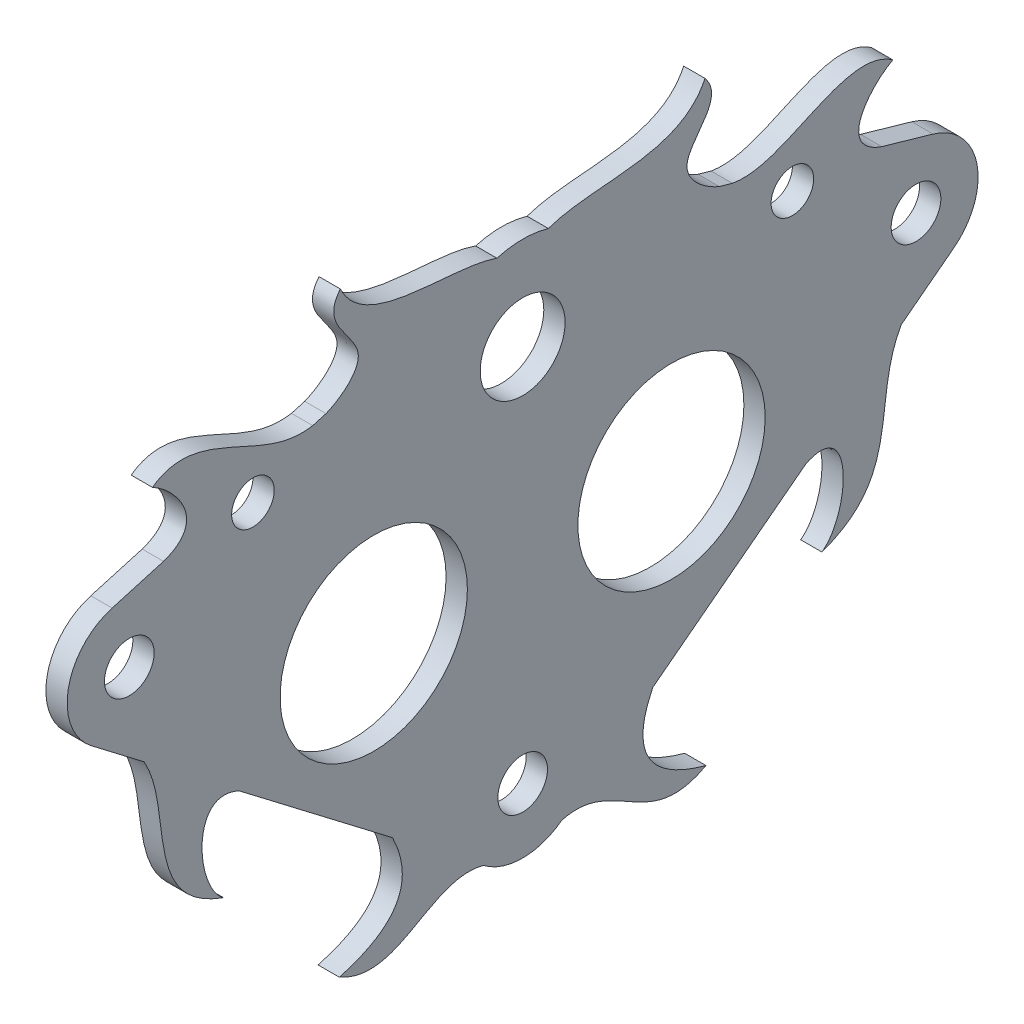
ISO-10303-21;
HEADER;
FILE_DESCRIPTION(('STEP AP214'),'2;1');
FILE_NAME('part.step','',(''),(''),'','','');
FILE_SCHEMA(('AUTOMOTIVE_DESIGN { 1 0 10303 214 1 1 1 1 }'));
ENDSEC;
DATA;
#1=APPLICATION_CONTEXT('core data for automotive mechanical design processes');
#2=APPLICATION_PROTOCOL_DEFINITION('international standard','automotive_design',2000,#1);
#3=PRODUCT_CONTEXT('',#1,'mechanical');
#4=PRODUCT('Part','Part','',(#3));
#5=PRODUCT_RELATED_PRODUCT_CATEGORY('part','',(#4));
#6=PRODUCT_DEFINITION_FORMATION('','',#4);
#7=PRODUCT_DEFINITION_CONTEXT('part definition',#1,'design');
#8=PRODUCT_DEFINITION('design','',#6,#7);
#9=PRODUCT_DEFINITION_SHAPE('','',#8);
#10=(LENGTH_UNIT() NAMED_UNIT(*) SI_UNIT(.MILLI.,.METRE.));
#11=(NAMED_UNIT(*) PLANE_ANGLE_UNIT() SI_UNIT($,.RADIAN.));
#12=(NAMED_UNIT(*) SI_UNIT($,.STERADIAN.) SOLID_ANGLE_UNIT());
#13=UNCERTAINTY_MEASURE_WITH_UNIT(LENGTH_MEASURE(1.E-05),#10,'distance_accuracy_value','');
#14=(GEOMETRIC_REPRESENTATION_CONTEXT(3) GLOBAL_UNCERTAINTY_ASSIGNED_CONTEXT((#13)) GLOBAL_UNIT_ASSIGNED_CONTEXT((#10,
#11,#12)) REPRESENTATION_CONTEXT('',''));
#15=CARTESIAN_POINT('',(0.,0.,0.));
#16=DIRECTION('',(0.,0.,1.));
#17=DIRECTION('',(1.,0.,0.));
#18=AXIS2_PLACEMENT_3D('',#15,#16,#17);
#19=CARTESIAN_POINT('',(-2.05703193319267,-31.9986930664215,25.7505001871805));
#20=DIRECTION('',(0.,-0.794497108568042,0.607267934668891));
#21=DIRECTION('',(0.,-0.607267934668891,-0.794497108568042));
#22=AXIS2_PLACEMENT_3D('',#19,#20,#21);
#23=PLANE('',#22);
#24=DIRECTION('',(1.,0.,0.));
#25=VECTOR('',#24,1.);
#26=CARTESIAN_POINT('',(-2.05703193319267,-21.1625366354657,39.9275947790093));
#27=LINE('',#26,#25);
#28=CARTESIAN_POINT('',(-2.05703193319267,-21.1625366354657,39.9275947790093));
#29=VERTEX_POINT('',#28);
#30=CARTESIAN_POINT('',(0.942968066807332,-21.1625366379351,39.9275947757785));
#31=VERTEX_POINT('',#30);
#32=EDGE_CURVE('E687',#29,#31,#27,.T.);
#33=ORIENTED_EDGE('',*,*,#32,.F.);
#34=DIRECTION('',(0.,-0.607267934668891,-0.794497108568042));
#35=VECTOR('',#34,1.);
#36=CARTESIAN_POINT('',(-2.05703193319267,-31.9986930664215,25.7505001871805));
#37=LINE('',#36,#35);
#38=CARTESIAN_POINT('',(-2.05703193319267,-37.6674903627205,18.333933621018));
#39=VERTEX_POINT('',#38);
#40=EDGE_CURVE('E43',#29,#39,#37,.T.);
#41=ORIENTED_EDGE('',*,*,#40,.T.);
#42=DIRECTION('',(1.,0.,0.));
#43=VECTOR('',#42,1.);
#44=CARTESIAN_POINT('',(-2.05703193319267,-37.6674903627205,18.333933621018));
#45=LINE('',#44,#43);
#46=CARTESIAN_POINT('',(0.942968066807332,-37.6674903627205,18.333933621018));
#47=VERTEX_POINT('',#46);
#48=EDGE_CURVE('E406',#39,#47,#45,.T.);
#49=ORIENTED_EDGE('',*,*,#48,.T.);
#50=DIRECTION('',(0.,-0.607267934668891,-0.794497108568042));
#51=VECTOR('',#50,1.);
#52=CARTESIAN_POINT('',(0.942968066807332,-31.9986930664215,25.7505001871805));
#53=LINE('',#52,#51);
#54=EDGE_CURVE('E62',#31,#47,#53,.T.);
#55=ORIENTED_EDGE('',*,*,#54,.F.);
#56=EDGE_LOOP('',(#33,#41,#49,#55));
#57=FACE_BOUND('',#56,.T.);
#58=ADVANCED_FACE('F39',(#57),#23,.T.);
#59=DIRECTION('',(1.,0.,0.));
#60=VECTOR('',#59,1.);
#61=CARTESIAN_POINT('',(-2.05703193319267,-10.9212101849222,53.3264650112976));
#62=LINE('',#61,#60);
#63=CARTESIAN_POINT('',(-2.05703193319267,-10.9212101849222,53.3264650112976));
#64=VERTEX_POINT('',#63);
#65=CARTESIAN_POINT('',(0.942968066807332,-10.9212101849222,53.3264650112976));
#66=VERTEX_POINT('',#65);
#67=EDGE_CURVE('E228',#64,#66,#62,.T.);
#68=ORIENTED_EDGE('',*,*,#67,.T.);
#69=CARTESIAN_POINT('',(0.942968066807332,-5.26166880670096,60.7309219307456));
#70=VERTEX_POINT('',#69);
#71=EDGE_CURVE('E259',#70,#66,#53,.T.);
#72=ORIENTED_EDGE('',*,*,#71,.F.);
#73=DIRECTION('',(-1.,0.,0.));
#74=VECTOR('',#73,1.);
#75=CARTESIAN_POINT('',(-2.05703193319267,-5.26166880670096,60.7309219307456));
#76=LINE('',#75,#74);
#77=CARTESIAN_POINT('',(-2.05703193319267,-5.26166880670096,60.7309219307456));
#78=VERTEX_POINT('',#77);
#79=EDGE_CURVE('E49',#70,#78,#76,.T.);
#80=ORIENTED_EDGE('',*,*,#79,.T.);
#81=EDGE_CURVE('E247',#78,#64,#37,.T.);
#82=ORIENTED_EDGE('',*,*,#81,.T.);
#83=EDGE_LOOP('',(#68,#72,#80,#82));
#84=FACE_BOUND('',#83,.T.);
#85=ADVANCED_FACE('F251',(#84),#23,.T.);
#86=CARTESIAN_POINT('',(-2.05703193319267,-31.9986930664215,-25.7491785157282));
#87=DIRECTION('',(0.,0.794497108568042,0.607267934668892));
#88=DIRECTION('',(0.,-0.607267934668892,0.794497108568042));
#89=AXIS2_PLACEMENT_3D('',#86,#87,#88);
#90=PLANE('',#89);
#91=DIRECTION('',(0.,-0.607267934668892,0.794497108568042));
#92=VECTOR('',#91,1.);
#93=CARTESIAN_POINT('',(0.942968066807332,-31.9986930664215,-25.7491785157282));
#94=LINE('',#93,#92);
#95=CARTESIAN_POINT('',(0.942968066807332,-21.1625366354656,-39.9262731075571));
#96=VERTEX_POINT('',#95);
#97=CARTESIAN_POINT('',(0.942968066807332,-37.6674903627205,-18.3326119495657));
#98=VERTEX_POINT('',#97);
#99=EDGE_CURVE('E330',#96,#98,#94,.T.);
#100=ORIENTED_EDGE('',*,*,#99,.T.);
#101=DIRECTION('',(1.,0.,0.));
#102=VECTOR('',#101,1.);
#103=CARTESIAN_POINT('',(-2.05703193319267,-37.6674903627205,-18.3326119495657));
#104=LINE('',#103,#102);
#105=CARTESIAN_POINT('',(-2.05703193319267,-37.6674903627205,-18.3326119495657));
#106=VERTEX_POINT('',#105);
#107=EDGE_CURVE('E464',#106,#98,#104,.T.);
#108=ORIENTED_EDGE('',*,*,#107,.F.);
#109=DIRECTION('',(0.,-0.607267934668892,0.794497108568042));
#110=VECTOR('',#109,1.);
#111=CARTESIAN_POINT('',(-2.05703193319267,-31.9986930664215,-25.7491785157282));
#112=LINE('',#111,#110);
#113=CARTESIAN_POINT('',(-2.05703193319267,-21.1625366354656,-39.9262731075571));
#114=VERTEX_POINT('',#113);
#115=EDGE_CURVE('E359',#114,#106,#112,.T.);
#116=ORIENTED_EDGE('',*,*,#115,.F.);
#117=DIRECTION('',(1.,0.,0.));
#118=VECTOR('',#117,1.);
#119=CARTESIAN_POINT('',(-2.05703193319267,-21.1625366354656,-39.9262731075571));
#120=LINE('',#119,#118);
#121=EDGE_CURVE('E519',#114,#96,#120,.T.);
#122=ORIENTED_EDGE('',*,*,#121,.T.);
#123=EDGE_LOOP('',(#100,#108,#116,#122));
#124=FACE_BOUND('',#123,.T.);
#125=ADVANCED_FACE('F627',(#124),#90,.F.);
#126=CARTESIAN_POINT('',(0.942968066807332,-5.26166880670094,-60.7296002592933));
#127=VERTEX_POINT('',#126);
#128=CARTESIAN_POINT('',(0.942968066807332,-10.9212101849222,-53.3251433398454));
#129=VERTEX_POINT('',#128);
#130=EDGE_CURVE('E328',#127,#129,#94,.T.);
#131=ORIENTED_EDGE('',*,*,#130,.T.);
#132=DIRECTION('',(1.,0.,0.));
#133=VECTOR('',#132,1.);
#134=CARTESIAN_POINT('',(-2.05703193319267,-10.9212101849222,-53.3251433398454));
#135=LINE('',#134,#133);
#136=CARTESIAN_POINT('',(-2.05703193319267,-10.9212101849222,-53.3251433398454));
#137=VERTEX_POINT('',#136);
#138=EDGE_CURVE('E720',#137,#129,#135,.T.);
#139=ORIENTED_EDGE('',*,*,#138,.F.);
#140=CARTESIAN_POINT('',(-2.05703193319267,-5.26166880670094,-60.7296002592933));
#141=VERTEX_POINT('',#140);
#142=EDGE_CURVE('E358',#141,#137,#112,.T.);
#143=ORIENTED_EDGE('',*,*,#142,.F.);
#144=DIRECTION('',(-1.,0.,0.));
#145=VECTOR('',#144,1.);
#146=CARTESIAN_POINT('',(-2.05703193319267,-5.26166880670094,-60.7296002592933));
#147=LINE('',#146,#145);
#148=EDGE_CURVE('E376',#127,#141,#147,.T.);
#149=ORIENTED_EDGE('',*,*,#148,.F.);
#150=EDGE_LOOP('',(#131,#139,#143,#149));
#151=FACE_BOUND('',#150,.T.);
#152=ADVANCED_FACE('F630',(#151),#90,.F.);
#153=CARTESIAN_POINT('',(-2.05703193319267,24.8116172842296,-6.64458938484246));
#154=DIRECTION('',(0.,0.961093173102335,-0.276224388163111));
#155=DIRECTION('',(0.,0.276224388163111,0.961093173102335));
#156=AXIS2_PLACEMENT_3D('',#153,#154,#155);
#157=PLANE('',#156);
#158=DIRECTION('',(0.,0.276224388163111,0.961093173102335));
#159=VECTOR('',#158,1.);
#160=CARTESIAN_POINT('',(-2.05703193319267,24.8116172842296,-6.64458938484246));
#161=LINE('',#160,#159);
#162=CARTESIAN_POINT('',(-2.05703193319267,10.0997461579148,-57.8329692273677));
#163=VERTEX_POINT('',#162);
#164=CARTESIAN_POINT('',(-2.05703193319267,12.1792744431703,-50.5974732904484));
#165=VERTEX_POINT('',#164);
#166=EDGE_CURVE('E290',#163,#165,#161,.T.);
#167=ORIENTED_EDGE('',*,*,#166,.T.);
#168=DIRECTION('',(1.,0.,0.));
#169=VECTOR('',#168,1.);
#170=CARTESIAN_POINT('',(-2.05703193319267,12.1792744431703,-50.5974732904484));
#171=LINE('',#170,#169);
#172=CARTESIAN_POINT('',(0.942968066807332,12.1792744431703,-50.5974732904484));
#173=VERTEX_POINT('',#172);
#174=EDGE_CURVE('E526',#165,#173,#171,.T.);
#175=ORIENTED_EDGE('',*,*,#174,.T.);
#176=DIRECTION('',(0.,0.276224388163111,0.961093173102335));
#177=VECTOR('',#176,1.);
#178=CARTESIAN_POINT('',(0.942968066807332,24.8116172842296,-6.64458938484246));
#179=LINE('',#178,#177);
#180=CARTESIAN_POINT('',(0.942968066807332,10.0997461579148,-57.8329692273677));
#181=VERTEX_POINT('',#180);
#182=EDGE_CURVE('E284',#181,#173,#179,.T.);
#183=ORIENTED_EDGE('',*,*,#182,.F.);
#184=DIRECTION('',(-1.,0.,0.));
#185=VECTOR('',#184,1.);
#186=CARTESIAN_POINT('',(-2.05703193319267,10.0997461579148,-57.8329692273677));
#187=LINE('',#186,#185);
#188=EDGE_CURVE('E378',#181,#163,#187,.T.);
#189=ORIENTED_EDGE('',*,*,#188,.T.);
#190=EDGE_LOOP('',(#167,#175,#183,#189));
#191=FACE_BOUND('',#190,.T.);
#192=ADVANCED_FACE('F637',(#191),#157,.T.);
#193=CARTESIAN_POINT('',(0.942968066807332,18.2241580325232,-29.5649482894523));
#194=VERTEX_POINT('',#193);
#195=CARTESIAN_POINT('',(0.942968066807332,18.7592735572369,-27.7030711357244));
#196=VERTEX_POINT('',#195);
#197=EDGE_CURVE('E289',#194,#196,#179,.T.);
#198=ORIENTED_EDGE('',*,*,#197,.F.);
#199=DIRECTION('',(1.,0.,0.));
#200=VECTOR('',#199,1.);
#201=CARTESIAN_POINT('',(-2.05703193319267,18.22415803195,-29.5649482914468));
#202=LINE('',#201,#200);
#203=CARTESIAN_POINT('',(-2.05703193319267,18.22415803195,-29.5649482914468));
#204=VERTEX_POINT('',#203);
#205=EDGE_CURVE('E533',#204,#194,#202,.T.);
#206=ORIENTED_EDGE('',*,*,#205,.F.);
#207=CARTESIAN_POINT('',(-2.05703193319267,18.7592735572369,-27.7030711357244));
#208=VERTEX_POINT('',#207);
#209=EDGE_CURVE('E303',#204,#208,#161,.T.);
#210=ORIENTED_EDGE('',*,*,#209,.T.);
#211=DIRECTION('',(1.,0.,0.));
#212=VECTOR('',#211,1.);
#213=CARTESIAN_POINT('',(-2.05703193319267,18.7592735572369,-27.7030711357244));
#214=LINE('',#213,#212);
#215=EDGE_CURVE('E586',#208,#196,#214,.T.);
#216=ORIENTED_EDGE('',*,*,#215,.T.);
#217=EDGE_LOOP('',(#198,#206,#210,#216));
#218=FACE_BOUND('',#217,.T.);
#219=ADVANCED_FACE('F640',(#218),#157,.T.);
#220=CARTESIAN_POINT('',(-2.05703193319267,24.8116172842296,6.64591105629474));
#221=DIRECTION('',(0.,-0.961093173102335,-0.276224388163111));
#222=DIRECTION('',(0.,0.276224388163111,-0.961093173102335));
#223=AXIS2_PLACEMENT_3D('',#220,#221,#222);
#224=PLANE('',#223);
#225=DIRECTION('',(1.,0.,0.));
#226=VECTOR('',#225,1.);
#227=CARTESIAN_POINT('',(-2.05703193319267,12.1792744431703,50.5987949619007));
#228=LINE('',#227,#226);
#229=CARTESIAN_POINT('',(-2.05703193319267,12.1792744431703,50.5987949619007));
#230=VERTEX_POINT('',#229);
#231=CARTESIAN_POINT('',(0.942968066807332,12.1792744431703,50.5987949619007));
#232=VERTEX_POINT('',#231);
#233=EDGE_CURVE('E594',#230,#232,#228,.T.);
#234=ORIENTED_EDGE('',*,*,#233,.F.);
#235=DIRECTION('',(0.,0.276224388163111,-0.961093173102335));
#236=VECTOR('',#235,1.);
#237=CARTESIAN_POINT('',(-2.05703193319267,24.8116172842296,6.64591105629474));
#238=LINE('',#237,#236);
#239=CARTESIAN_POINT('',(-2.05703193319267,10.0997461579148,57.83429089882));
#240=VERTEX_POINT('',#239);
#241=EDGE_CURVE('E275',#240,#230,#238,.T.);
#242=ORIENTED_EDGE('',*,*,#241,.F.);
#243=DIRECTION('',(-1.,0.,0.));
#244=VECTOR('',#243,1.);
#245=CARTESIAN_POINT('',(-2.05703193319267,10.0997461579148,57.83429089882));
#246=LINE('',#245,#244);
#247=CARTESIAN_POINT('',(0.942968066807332,10.0997461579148,57.83429089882));
#248=VERTEX_POINT('',#247);
#249=EDGE_CURVE('E386',#248,#240,#246,.T.);
#250=ORIENTED_EDGE('',*,*,#249,.F.);
#251=DIRECTION('',(0.,0.276224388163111,-0.961093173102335));
#252=VECTOR('',#251,1.);
#253=CARTESIAN_POINT('',(0.942968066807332,24.8116172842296,6.64591105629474));
#254=LINE('',#253,#252);
#255=EDGE_CURVE('E390',#248,#232,#254,.T.);
#256=ORIENTED_EDGE('',*,*,#255,.T.);
#257=EDGE_LOOP('',(#234,#242,#250,#256));
#258=FACE_BOUND('',#257,.T.);
#259=ADVANCED_FACE('F650',(#258),#224,.F.);
#260=CARTESIAN_POINT('',(-2.05703193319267,1.69018089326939,55.4173275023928));
#261=DIRECTION('',(1.,0.,0.));
#262=DIRECTION('',(0.,0.,-1.));
#263=AXIS2_PLACEMENT_3D('',#260,#261,#262);
#264=CYLINDRICAL_SURFACE('',#263,8.74999999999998);
#265=ORIENTED_EDGE('',*,*,#79,.F.);
#266=CARTESIAN_POINT('',(0.942968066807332,1.69018089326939,55.4173275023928));
#267=DIRECTION('',(1.,0.,0.));
#268=DIRECTION('',(0.,0.,-1.));
#269=AXIS2_PLACEMENT_3D('',#266,#267,#268);
#270=CIRCLE('',#269,8.74999999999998);
#271=EDGE_CURVE('E393',#248,#70,#270,.T.);
#272=ORIENTED_EDGE('',*,*,#271,.F.);
#273=ORIENTED_EDGE('',*,*,#249,.T.);
#274=CARTESIAN_POINT('',(-2.05703193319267,1.69018089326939,55.4173275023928));
#275=DIRECTION('',(1.,0.,0.));
#276=DIRECTION('',(0.,0.,-1.));
#277=AXIS2_PLACEMENT_3D('',#274,#275,#276);
#278=CIRCLE('',#277,8.74999999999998);
#279=EDGE_CURVE('E252',#240,#78,#278,.T.);
#280=ORIENTED_EDGE('',*,*,#279,.T.);
#281=EDGE_LOOP('',(#265,#272,#273,#280));
#282=FACE_BOUND('',#281,.T.);
#283=ADVANCED_FACE('F648',(#282),#264,.T.);
#284=DIRECTION('',(1.,0.,0.));
#285=VECTOR('',#284,1.);
#286=CARTESIAN_POINT('',(-2.05703193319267,18.22415803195,29.5662699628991));
#287=LINE('',#286,#285);
#288=CARTESIAN_POINT('',(-2.05703193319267,18.2241580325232,29.5662699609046));
#289=VERTEX_POINT('',#288);
#290=CARTESIAN_POINT('',(0.942968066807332,18.22415803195,29.5662699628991));
#291=VERTEX_POINT('',#290);
#292=EDGE_CURVE('E571',#289,#291,#287,.T.);
#293=ORIENTED_EDGE('',*,*,#292,.T.);
#294=CARTESIAN_POINT('',(0.942968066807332,18.7592735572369,27.7043928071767));
#295=VERTEX_POINT('',#294);
#296=EDGE_CURVE('E281',#291,#295,#254,.T.);
#297=ORIENTED_EDGE('',*,*,#296,.T.);
#298=DIRECTION('',(1.,0.,0.));
#299=VECTOR('',#298,1.);
#300=CARTESIAN_POINT('',(-2.05703193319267,18.7592735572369,27.7043928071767));
#301=LINE('',#300,#299);
#302=CARTESIAN_POINT('',(-2.05703193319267,18.7592735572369,27.7043928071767));
#303=VERTEX_POINT('',#302);
#304=EDGE_CURVE('E335',#303,#295,#301,.T.);
#305=ORIENTED_EDGE('',*,*,#304,.F.);
#306=EDGE_CURVE('E254',#289,#303,#238,.T.);
#307=ORIENTED_EDGE('',*,*,#306,.F.);
#308=EDGE_LOOP('',(#293,#297,#305,#307));
#309=FACE_BOUND('',#308,.T.);
#310=ADVANCED_FACE('F644',(#309),#224,.F.);
#311=CARTESIAN_POINT('',(-2.05703193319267,13.0651808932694,0.000660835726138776));
#312=DIRECTION('',(1.,0.,0.));
#313=DIRECTION('',(0.,0.,-1.));
#314=AXIS2_PLACEMENT_3D('',#311,#312,#313);
#315=CYLINDRICAL_SURFACE('',#314,13.125);
#316=DIRECTION('',(-1.,0.,0.));
#317=VECTOR('',#316,1.);
#318=CARTESIAN_POINT('',(-2.05703193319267,25.6795287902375,3.62610593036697));
#319=LINE('',#318,#317);
#320=CARTESIAN_POINT('',(0.942968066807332,25.6795287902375,3.62610593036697));
#321=VERTEX_POINT('',#320);
#322=CARTESIAN_POINT('',(-2.05703193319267,25.6795287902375,3.62610593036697));
#323=VERTEX_POINT('',#322);
#324=EDGE_CURVE('E383',#321,#323,#319,.T.);
#325=ORIENTED_EDGE('',*,*,#324,.F.);
#326=CARTESIAN_POINT('',(0.942968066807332,13.0651808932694,0.000660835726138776));
#327=DIRECTION('',(1.,0.,0.));
#328=DIRECTION('',(0.,0.,-1.));
#329=AXIS2_PLACEMENT_3D('',#326,#327,#328);
#330=CIRCLE('',#329,13.125);
#331=CARTESIAN_POINT('',(0.942968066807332,25.6795287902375,-3.6247842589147));
#332=VERTEX_POINT('',#331);
#333=EDGE_CURVE('E296',#332,#321,#330,.T.);
#334=ORIENTED_EDGE('',*,*,#333,.F.);
#335=DIRECTION('',(-1.,0.,0.));
#336=VECTOR('',#335,1.);
#337=CARTESIAN_POINT('',(-2.05703193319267,25.6795287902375,-3.6247842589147));
#338=LINE('',#337,#336);
#339=CARTESIAN_POINT('',(-2.05703193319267,25.6795287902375,-3.6247842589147));
#340=VERTEX_POINT('',#339);
#341=EDGE_CURVE('E380',#332,#340,#338,.T.);
#342=ORIENTED_EDGE('',*,*,#341,.T.);
#343=CARTESIAN_POINT('',(-2.05703193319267,13.0651808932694,0.000660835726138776));
#344=DIRECTION('',(1.,0.,0.));
#345=DIRECTION('',(0.,0.,-1.));
#346=AXIS2_PLACEMENT_3D('',#343,#344,#345);
#347=CIRCLE('',#346,13.125);
#348=EDGE_CURVE('E271',#340,#323,#347,.T.);
#349=ORIENTED_EDGE('',*,*,#348,.T.);
#350=EDGE_LOOP('',(#325,#334,#342,#349));
#351=FACE_BOUND('',#350,.T.);
#352=ADVANCED_FACE('F635',(#351),#315,.T.);
#353=CARTESIAN_POINT('',(-2.05703193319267,1.69018089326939,-55.4160058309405));
#354=DIRECTION('',(1.,0.,0.));
#355=DIRECTION('',(0.,0.,-1.));
#356=AXIS2_PLACEMENT_3D('',#353,#354,#355);
#357=CYLINDRICAL_SURFACE('',#356,8.74999999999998);
#358=ORIENTED_EDGE('',*,*,#188,.F.);
#359=CARTESIAN_POINT('',(0.942968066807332,1.69018089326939,-55.4160058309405));
#360=DIRECTION('',(1.,0.,0.));
#361=DIRECTION('',(0.,0.,-1.));
#362=AXIS2_PLACEMENT_3D('',#359,#360,#361);
#363=CIRCLE('',#362,8.74999999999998);
#364=EDGE_CURVE('E288',#181,#127,#363,.F.);
#365=ORIENTED_EDGE('',*,*,#364,.T.);
#366=ORIENTED_EDGE('',*,*,#148,.T.);
#367=CARTESIAN_POINT('',(-2.05703193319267,1.69018089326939,-55.4160058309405));
#368=DIRECTION('',(1.,0.,0.));
#369=DIRECTION('',(0.,0.,-1.));
#370=AXIS2_PLACEMENT_3D('',#367,#368,#369);
#371=CIRCLE('',#370,8.74999999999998);
#372=EDGE_CURVE('E306',#163,#141,#371,.F.);
#373=ORIENTED_EDGE('',*,*,#372,.F.);
#374=EDGE_LOOP('',(#358,#365,#366,#373));
#375=FACE_BOUND('',#374,.T.);
#376=ADVANCED_FACE('F631',(#375),#357,.T.);
#377=CARTESIAN_POINT('',(-2.05703193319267,-40.2254131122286,0.000660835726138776));
#378=DIRECTION('',(1.,0.,0.));
#379=DIRECTION('',(0.,0.,-1.));
#380=AXIS2_PLACEMENT_3D('',#377,#378,#379);
#381=CYLINDRICAL_SURFACE('',#380,9.10094647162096);
#382=CARTESIAN_POINT('',(0.942968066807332,-40.2254131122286,0.000660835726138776));
#383=DIRECTION('',(1.,0.,0.));
#384=DIRECTION('',(0.,0.,-1.));
#385=AXIS2_PLACEMENT_3D('',#382,#383,#384);
#386=CIRCLE('',#385,9.10094647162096);
#387=CARTESIAN_POINT('',(0.942968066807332,-47.4560887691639,5.52737380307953));
#388=VERTEX_POINT('',#387);
#389=CARTESIAN_POINT('',(0.942968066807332,-47.4560887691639,-5.52605213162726));
#390=VERTEX_POINT('',#389);
#391=EDGE_CURVE('E329',#388,#390,#386,.T.);
#392=ORIENTED_EDGE('',*,*,#391,.F.);
#393=DIRECTION('',(-1.,0.,0.));
#394=VECTOR('',#393,1.);
#395=CARTESIAN_POINT('',(-2.05703193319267,-47.4560887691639,5.52737380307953));
#396=LINE('',#395,#394);
#397=CARTESIAN_POINT('',(-2.05703193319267,-47.4560887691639,5.52737380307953));
#398=VERTEX_POINT('',#397);
#399=EDGE_CURVE('E11',#388,#398,#396,.T.);
#400=ORIENTED_EDGE('',*,*,#399,.T.);
#401=CARTESIAN_POINT('',(-2.05703193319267,-40.2254131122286,0.000660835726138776));
#402=DIRECTION('',(1.,0.,0.));
#403=DIRECTION('',(0.,0.,-1.));
#404=AXIS2_PLACEMENT_3D('',#401,#402,#403);
#405=CIRCLE('',#404,9.10094647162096);
#406=CARTESIAN_POINT('',(-2.05703193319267,-47.4560887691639,-5.52605213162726));
#407=VERTEX_POINT('',#406);
#408=EDGE_CURVE('E256',#398,#407,#405,.T.);
#409=ORIENTED_EDGE('',*,*,#408,.T.);
#410=DIRECTION('',(-1.,0.,0.));
#411=VECTOR('',#410,1.);
#412=CARTESIAN_POINT('',(-2.05703193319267,-47.4560887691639,-5.52605213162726));
#413=LINE('',#412,#411);
#414=EDGE_CURVE('E327',#390,#407,#413,.T.);
#415=ORIENTED_EDGE('',*,*,#414,.F.);
#416=EDGE_LOOP('',(#392,#400,#409,#415));
#417=FACE_BOUND('',#416,.T.);
#418=ADVANCED_FACE('F634',(#417),#381,.T.);
#419=CARTESIAN_POINT('',(-2.05703193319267,-12.6208032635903,20.9781027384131));
#420=DIRECTION('',(1.,0.,0.));
#421=DIRECTION('',(0.,0.,-1.));
#422=AXIS2_PLACEMENT_3D('',#419,#420,#421);
#423=CYLINDRICAL_SURFACE('',#422,13.1927366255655);
#424=CARTESIAN_POINT('',(-2.05703193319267,-12.6208032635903,20.9781027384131));
#425=DIRECTION('',(1.,0.,0.));
#426=DIRECTION('',(0.,0.,-1.));
#427=AXIS2_PLACEMENT_3D('',#424,#425,#426);
#428=CIRCLE('',#427,13.1927366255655);
#429=CARTESIAN_POINT('',(-2.05703193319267,-12.6208032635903,7.78536611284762));
#430=VERTEX_POINT('',#429);
#431=EDGE_CURVE('E310',#430,#430,#428,.T.);
#432=ORIENTED_EDGE('',*,*,#431,.F.);
#433=EDGE_LOOP('',(#432));
#434=FACE_BOUND('',#433,.T.);
#435=CARTESIAN_POINT('',(0.942968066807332,-12.6208032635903,20.9781027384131));
#436=DIRECTION('',(1.,0.,0.));
#437=DIRECTION('',(0.,0.,-1.));
#438=AXIS2_PLACEMENT_3D('',#435,#436,#437);
#439=CIRCLE('',#438,13.1927366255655);
#440=CARTESIAN_POINT('',(0.942968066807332,-12.6208032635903,7.78536611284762));
#441=VERTEX_POINT('',#440);
#442=EDGE_CURVE('E740',#441,#441,#439,.T.);
#443=ORIENTED_EDGE('',*,*,#442,.T.);
#444=EDGE_LOOP('',(#443));
#445=FACE_BOUND('',#444,.T.);
#446=ADVANCED_FACE('F658',(#434,#445),#423,.F.);
#447=CARTESIAN_POINT('',(-2.05703193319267,-12.6208032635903,-20.9767810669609));
#448=DIRECTION('',(1.,0.,0.));
#449=DIRECTION('',(0.,0.,-1.));
#450=AXIS2_PLACEMENT_3D('',#447,#448,#449);
#451=CYLINDRICAL_SURFACE('',#450,13.1927366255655);
#452=CARTESIAN_POINT('',(-2.05703193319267,-12.6208032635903,-20.9767810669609));
#453=DIRECTION('',(1.,0.,0.));
#454=DIRECTION('',(0.,0.,-1.));
#455=AXIS2_PLACEMENT_3D('',#452,#453,#454);
#456=CIRCLE('',#455,13.1927366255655);
#457=CARTESIAN_POINT('',(-2.05703193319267,-12.6208032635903,-34.1695176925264));
#458=VERTEX_POINT('',#457);
#459=EDGE_CURVE('E313',#458,#458,#456,.F.);
#460=ORIENTED_EDGE('',*,*,#459,.T.);
#461=EDGE_LOOP('',(#460));
#462=FACE_BOUND('',#461,.T.);
#463=CARTESIAN_POINT('',(0.942968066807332,-12.6208032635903,-20.9767810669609));
#464=DIRECTION('',(1.,0.,0.));
#465=DIRECTION('',(0.,0.,-1.));
#466=AXIS2_PLACEMENT_3D('',#463,#464,#465);
#467=CIRCLE('',#466,13.1927366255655);
#468=CARTESIAN_POINT('',(0.942968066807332,-12.6208032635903,-34.1695176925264));
#469=VERTEX_POINT('',#468);
#470=EDGE_CURVE('E742',#469,#469,#467,.F.);
#471=ORIENTED_EDGE('',*,*,#470,.F.);
#472=EDGE_LOOP('',(#471));
#473=FACE_BOUND('',#472,.T.);
#474=ADVANCED_FACE('F662',(#462,#473),#451,.F.);
#475=CARTESIAN_POINT('',(-2.05703193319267,13.0651808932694,0.000660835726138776));
#476=DIRECTION('',(1.,0.,0.));
#477=DIRECTION('',(0.,0.,-1.));
#478=AXIS2_PLACEMENT_3D('',#475,#476,#477);
#479=CYLINDRICAL_SURFACE('',#478,5.97916666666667);
#480=CARTESIAN_POINT('',(-2.05703193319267,13.0651808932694,0.000660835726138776));
#481=DIRECTION('',(1.,0.,0.));
#482=DIRECTION('',(0.,0.,-1.));
#483=AXIS2_PLACEMENT_3D('',#480,#481,#482);
#484=CIRCLE('',#483,5.97916666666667);
#485=CARTESIAN_POINT('',(-2.05703193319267,13.0651808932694,-5.97850583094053));
#486=VERTEX_POINT('',#485);
#487=EDGE_CURVE('E316',#486,#486,#484,.T.);
#488=ORIENTED_EDGE('',*,*,#487,.F.);
#489=EDGE_LOOP('',(#488));
#490=FACE_BOUND('',#489,.T.);
#491=CARTESIAN_POINT('',(0.942968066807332,13.0651808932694,0.000660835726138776));
#492=DIRECTION('',(1.,0.,0.));
#493=DIRECTION('',(0.,0.,-1.));
#494=AXIS2_PLACEMENT_3D('',#491,#492,#493);
#495=CIRCLE('',#494,5.97916666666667);
#496=CARTESIAN_POINT('',(0.942968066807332,13.0651808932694,-5.97850583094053));
#497=VERTEX_POINT('',#496);
#498=EDGE_CURVE('E746',#497,#497,#495,.T.);
#499=ORIENTED_EDGE('',*,*,#498,.T.);
#500=EDGE_LOOP('',(#499));
#501=FACE_BOUND('',#500,.T.);
#502=ADVANCED_FACE('F666',(#490,#501),#479,.F.);
#503=CARTESIAN_POINT('',(-2.05703193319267,1.69018089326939,55.4173275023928));
#504=DIRECTION('',(-1.,0.,0.));
#505=DIRECTION('',(0.,0.,1.));
#506=AXIS2_PLACEMENT_3D('',#503,#504,#505);
#507=CYLINDRICAL_SURFACE('',#506,3.5);
#508=CARTESIAN_POINT('',(-2.05703193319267,1.69018089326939,55.4173275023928));
#509=DIRECTION('',(-1.,0.,0.));
#510=DIRECTION('',(0.,0.,1.));
#511=AXIS2_PLACEMENT_3D('',#508,#509,#510);
#512=CIRCLE('',#511,3.5);
#513=CARTESIAN_POINT('',(-2.05703193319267,1.69018089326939,58.9173275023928));
#514=VERTEX_POINT('',#513);
#515=EDGE_CURVE('E319',#514,#514,#512,.T.);
#516=ORIENTED_EDGE('',*,*,#515,.T.);
#517=EDGE_LOOP('',(#516));
#518=FACE_BOUND('',#517,.T.);
#519=CARTESIAN_POINT('',(0.942968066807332,1.69018089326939,55.4173275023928));
#520=DIRECTION('',(-1.,0.,0.));
#521=DIRECTION('',(0.,0.,1.));
#522=AXIS2_PLACEMENT_3D('',#519,#520,#521);
#523=CIRCLE('',#522,3.5);
#524=CARTESIAN_POINT('',(0.942968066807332,1.69018089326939,58.9173275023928));
#525=VERTEX_POINT('',#524);
#526=EDGE_CURVE('E372',#525,#525,#523,.T.);
#527=ORIENTED_EDGE('',*,*,#526,.F.);
#528=EDGE_LOOP('',(#527));
#529=FACE_BOUND('',#528,.T.);
#530=ADVANCED_FACE('F670',(#518,#529),#507,.F.);
#531=CARTESIAN_POINT('',(-2.05703193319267,-40.2254131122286,0.000660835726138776));
#532=DIRECTION('',(-1.,0.,0.));
#533=DIRECTION('',(0.,0.,1.));
#534=AXIS2_PLACEMENT_3D('',#531,#532,#533);
#535=CYLINDRICAL_SURFACE('',#534,3.5);
#536=CARTESIAN_POINT('',(-2.05703193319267,-40.2254131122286,0.000660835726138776));
#537=DIRECTION('',(-1.,0.,0.));
#538=DIRECTION('',(0.,0.,1.));
#539=AXIS2_PLACEMENT_3D('',#536,#537,#538);
#540=CIRCLE('',#539,3.5);
#541=CARTESIAN_POINT('',(-2.05703193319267,-40.2254131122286,3.50066083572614));
#542=VERTEX_POINT('',#541);
#543=EDGE_CURVE('E322',#542,#542,#540,.T.);
#544=ORIENTED_EDGE('',*,*,#543,.T.);
#545=EDGE_LOOP('',(#544));
#546=FACE_BOUND('',#545,.T.);
#547=CARTESIAN_POINT('',(0.942968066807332,-40.2254131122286,0.000660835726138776));
#548=DIRECTION('',(-1.,0.,0.));
#549=DIRECTION('',(0.,0.,1.));
#550=AXIS2_PLACEMENT_3D('',#547,#548,#549);
#551=CIRCLE('',#550,3.5);
#552=CARTESIAN_POINT('',(0.942968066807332,-40.2254131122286,3.50066083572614));
#553=VERTEX_POINT('',#552);
#554=EDGE_CURVE('E367',#553,#553,#551,.T.);
#555=ORIENTED_EDGE('',*,*,#554,.F.);
#556=EDGE_LOOP('',(#555));
#557=FACE_BOUND('',#556,.T.);
#558=ADVANCED_FACE('F673',(#546,#557),#535,.F.);
#559=CARTESIAN_POINT('',(-2.05703193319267,1.69018089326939,-55.4160058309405));
#560=DIRECTION('',(-1.,0.,0.));
#561=DIRECTION('',(0.,0.,1.));
#562=AXIS2_PLACEMENT_3D('',#559,#560,#561);
#563=CYLINDRICAL_SURFACE('',#562,3.5);
#564=CARTESIAN_POINT('',(-2.05703193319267,1.69018089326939,-55.4160058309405));
#565=DIRECTION('',(-1.,0.,0.));
#566=DIRECTION('',(0.,0.,1.));
#567=AXIS2_PLACEMENT_3D('',#564,#565,#566);
#568=CIRCLE('',#567,3.5);
#569=CARTESIAN_POINT('',(-2.05703193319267,1.69018089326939,-51.9160058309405));
#570=VERTEX_POINT('',#569);
#571=EDGE_CURVE('E325',#570,#570,#568,.T.);
#572=ORIENTED_EDGE('',*,*,#571,.T.);
#573=EDGE_LOOP('',(#572));
#574=FACE_BOUND('',#573,.T.);
#575=CARTESIAN_POINT('',(0.942968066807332,1.69018089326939,-55.4160058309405));
#576=DIRECTION('',(-1.,0.,0.));
#577=DIRECTION('',(0.,0.,1.));
#578=AXIS2_PLACEMENT_3D('',#575,#576,#577);
#579=CIRCLE('',#578,3.5);
#580=CARTESIAN_POINT('',(0.942968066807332,1.69018089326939,-51.9160058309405));
#581=VERTEX_POINT('',#580);
#582=EDGE_CURVE('E363',#581,#581,#579,.T.);
#583=ORIENTED_EDGE('',*,*,#582,.F.);
#584=EDGE_LOOP('',(#583));
#585=FACE_BOUND('',#584,.T.);
#586=ADVANCED_FACE('F41',(#574,#585),#563,.F.);
#587=CARTESIAN_POINT('',(-2.05703193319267,1.69018089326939,0.000660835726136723));
#588=DIRECTION('',(1.,0.,0.));
#589=DIRECTION('',(0.,0.,-1.));
#590=AXIS2_PLACEMENT_3D('',#587,#588,#589);
#591=PLANE('',#590);
#592=CARTESIAN_POINT('',(-2.05703193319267,13.0651808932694,38.0006608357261));
#593=DIRECTION('',(1.,0.,0.));
#594=DIRECTION('',(0.,0.,-1.));
#595=AXIS2_PLACEMENT_3D('',#592,#593,#594);
#596=CIRCLE('',#595,3.);
#597=CARTESIAN_POINT('',(-2.05703193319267,13.0651808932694,35.0006608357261));
#598=VERTEX_POINT('',#597);
#599=EDGE_CURVE('E1221',#598,#598,#596,.T.);
#600=ORIENTED_EDGE('',*,*,#599,.T.);
#601=EDGE_LOOP('',(#600));
#602=FACE_BOUND('',#601,.T.);
#603=CARTESIAN_POINT('',(-2.05703193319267,13.0651808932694,-37.9993391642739));
#604=DIRECTION('',(1.,0.,0.));
#605=DIRECTION('',(0.,0.,-1.));
#606=AXIS2_PLACEMENT_3D('',#603,#604,#605);
#607=CIRCLE('',#606,3.);
#608=CARTESIAN_POINT('',(-2.05703193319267,13.0651808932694,-40.9993391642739));
#609=VERTEX_POINT('',#608);
#610=EDGE_CURVE('E1191',#609,#609,#607,.T.);
#611=ORIENTED_EDGE('',*,*,#610,.T.);
#612=EDGE_LOOP('',(#611));
#613=FACE_BOUND('',#612,.T.);
#614=ORIENTED_EDGE('',*,*,#142,.T.);
#615=CARTESIAN_POINT('',(-2.05703193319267,-10.9212101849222,-53.3251433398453));
#616=CARTESIAN_POINT('',(-2.05703193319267,-18.4888958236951,-49.0246993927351));
#617=CARTESIAN_POINT('',(-2.05703193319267,-28.9656562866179,-53.7805598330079));
#618=CARTESIAN_POINT('',(-2.05703193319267,-33.0655925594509,-42.159506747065));
#619=B_SPLINE_CURVE_WITH_KNOTS('',3,(#615,#616,#617,#618),.UNSPECIFIED.,.F.,.F.,(4,4),(0.,1.),.UNSPECIFIED.);
#620=CARTESIAN_POINT('',(-2.05703193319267,-33.0655925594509,-42.159506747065));
#621=VERTEX_POINT('',#620);
#622=EDGE_CURVE('E477',#137,#621,#619,.T.);
#623=ORIENTED_EDGE('',*,*,#622,.T.);
#624=CARTESIAN_POINT('',(-2.05703193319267,-33.0655925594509,-42.159506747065));
#625=CARTESIAN_POINT('',(-2.05703193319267,-29.6640415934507,-46.9327632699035));
#626=CARTESIAN_POINT('',(-2.05703193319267,-13.0108404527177,-46.9848309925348));
#627=CARTESIAN_POINT('',(-2.05703193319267,-24.7717836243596,-35.2042449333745));
#628=B_SPLINE_CURVE_WITH_KNOTS('',3,(#624,#625,#626,#627),.UNSPECIFIED.,.F.,.F.,(4,4),(0.,1.),.UNSPECIFIED.);
#629=EDGE_CURVE('E472',#621,#114,#628,.T.);
#630=ORIENTED_EDGE('',*,*,#629,.T.);
#631=ORIENTED_EDGE('',*,*,#115,.T.);
#632=CARTESIAN_POINT('',(-2.05703193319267,-37.6674903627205,-18.3326119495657));
#633=CARTESIAN_POINT('',(-2.05703193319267,-47.5800311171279,-13.4497219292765));
#634=CARTESIAN_POINT('',(-2.05703193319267,-50.9456832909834,-25.828085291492));
#635=B_SPLINE_CURVE_WITH_KNOTS('',2,(#632,#633,#634),.UNSPECIFIED.,.F.,.F.,(3,3),(0.,1.),.UNSPECIFIED.);
#636=CARTESIAN_POINT('',(-2.05703193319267,-50.9456832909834,-25.828085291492));
#637=VERTEX_POINT('',#636);
#638=EDGE_CURVE('E438',#106,#637,#635,.T.);
#639=ORIENTED_EDGE('',*,*,#638,.T.);
#640=CARTESIAN_POINT('',(-2.05703193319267,-50.9456832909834,-25.828085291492));
#641=CARTESIAN_POINT('',(-2.05703193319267,-55.5439248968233,-17.4505933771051));
#642=CARTESIAN_POINT('',(-2.05703193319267,-45.4276512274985,-13.1933678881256));
#643=CARTESIAN_POINT('',(-2.05703193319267,-47.4560887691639,-5.52605213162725));
#644=B_SPLINE_CURVE_WITH_KNOTS('',3,(#640,#641,#642,#643),.UNSPECIFIED.,.F.,.F.,(4,4),(0.,1.),.UNSPECIFIED.);
#645=EDGE_CURVE('E444',#637,#407,#644,.T.);
#646=ORIENTED_EDGE('',*,*,#645,.T.);
#647=ORIENTED_EDGE('',*,*,#408,.F.);
#648=CARTESIAN_POINT('',(-2.05703193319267,-50.9456832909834,25.8294069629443));
#649=CARTESIAN_POINT('',(-2.05703193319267,-55.5439248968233,17.4519150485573));
#650=CARTESIAN_POINT('',(-2.05703193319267,-45.4276512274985,13.1946895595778));
#651=CARTESIAN_POINT('',(-2.05703193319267,-47.4560887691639,5.52737380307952));
#652=B_SPLINE_CURVE_WITH_KNOTS('',3,(#648,#649,#650,#651),.UNSPECIFIED.,.F.,.F.,(4,4),(0.,1.),.UNSPECIFIED.);
#653=CARTESIAN_POINT('',(-2.05703193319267,-50.9456832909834,25.8294069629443));
#654=VERTEX_POINT('',#653);
#655=EDGE_CURVE('E404',#654,#398,#652,.T.);
#656=ORIENTED_EDGE('',*,*,#655,.F.);
#657=CARTESIAN_POINT('',(-2.05703193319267,-37.6674903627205,18.333933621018));
#658=CARTESIAN_POINT('',(-2.05703193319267,-47.5800311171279,13.4510436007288));
#659=CARTESIAN_POINT('',(-2.05703193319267,-50.9456832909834,25.8294069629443));
#660=B_SPLINE_CURVE_WITH_KNOTS('',2,(#657,#658,#659),.UNSPECIFIED.,.F.,.F.,(3,3),(0.,1.),.UNSPECIFIED.);
#661=EDGE_CURVE('E400',#39,#654,#660,.T.);
#662=ORIENTED_EDGE('',*,*,#661,.F.);
#663=ORIENTED_EDGE('',*,*,#40,.F.);
#664=CARTESIAN_POINT('',(-2.05703193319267,-33.0655925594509,42.1608284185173));
#665=CARTESIAN_POINT('',(-2.05703193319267,-29.6640415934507,46.9340849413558));
#666=CARTESIAN_POINT('',(-2.05703193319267,-13.0108404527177,46.9861526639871));
#667=CARTESIAN_POINT('',(-2.05703193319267,-24.7717836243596,35.2055666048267));
#668=B_SPLINE_CURVE_WITH_KNOTS('',3,(#664,#665,#666,#667),.UNSPECIFIED.,.F.,.F.,(4,4),(0.,1.),.UNSPECIFIED.);
#669=CARTESIAN_POINT('',(-2.05703193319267,-33.0655925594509,42.1608284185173));
#670=VERTEX_POINT('',#669);
#671=EDGE_CURVE('E239',#670,#29,#668,.T.);
#672=ORIENTED_EDGE('',*,*,#671,.F.);
#673=CARTESIAN_POINT('',(-2.05703193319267,-10.9212101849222,53.3264650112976));
#674=CARTESIAN_POINT('',(-2.05703193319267,-18.4888958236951,49.0260210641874));
#675=CARTESIAN_POINT('',(-2.05703193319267,-28.9656562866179,53.7818815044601));
#676=CARTESIAN_POINT('',(-2.05703193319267,-33.0655925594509,42.1608284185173));
#677=B_SPLINE_CURVE_WITH_KNOTS('',3,(#673,#674,#675,#676),.UNSPECIFIED.,.F.,.F.,(4,4),(0.,1.),.UNSPECIFIED.);
#678=EDGE_CURVE('E231',#64,#670,#677,.T.);
#679=ORIENTED_EDGE('',*,*,#678,.F.);
#680=ORIENTED_EDGE('',*,*,#81,.F.);
#681=ORIENTED_EDGE('',*,*,#279,.F.);
#682=ORIENTED_EDGE('',*,*,#241,.T.);
#683=CARTESIAN_POINT('',(-2.05703193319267,21.9825607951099,52.1567846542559));
#684=CARTESIAN_POINT('',(-2.05703193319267,20.3433579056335,48.9662471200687));
#685=CARTESIAN_POINT('',(-2.05703193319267,14.4552040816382,44.0026604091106));
#686=CARTESIAN_POINT('',(-2.05703193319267,12.1792744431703,50.5987949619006));
#687=B_SPLINE_CURVE_WITH_KNOTS('',3,(#683,#684,#685,#686),.UNSPECIFIED.,.F.,.F.,(4,4),(0.,1.),.UNSPECIFIED.);
#688=CARTESIAN_POINT('',(-2.05703193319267,21.9825607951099,52.1567846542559));
#689=VERTEX_POINT('',#688);
#690=EDGE_CURVE('E565',#689,#230,#687,.T.);
#691=ORIENTED_EDGE('',*,*,#690,.F.);
#692=CARTESIAN_POINT('',(-2.05703193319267,32.9640338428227,25.688618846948));
#693=CARTESIAN_POINT('',(-2.05703193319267,29.2228525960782,28.7638940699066));
#694=CARTESIAN_POINT('',(-2.05703193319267,24.6417801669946,19.5604244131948));
#695=CARTESIAN_POINT('',(-2.05703193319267,16.9634414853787,28.676068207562));
#696=CARTESIAN_POINT('',(-2.05703193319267,19.4969214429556,38.9716326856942));
#697=CARTESIAN_POINT('',(-2.05703193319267,25.2649924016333,47.5784470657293));
#698=CARTESIAN_POINT('',(-2.05703193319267,21.9825607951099,52.1567846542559));
#699=B_SPLINE_CURVE_WITH_KNOTS('',3,(#692,#693,#694,#695,#696,#697,#698),.UNSPECIFIED.,.F.,.F.,
(4,1,1,1,4),(0.,0.242229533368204,0.399867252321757,0.618209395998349,1.),.UNSPECIFIED.);
#700=EDGE_CURVE('E572',#289,#689,#699,.T.);
#701=ORIENTED_EDGE('',*,*,#700,.F.);
#702=ORIENTED_EDGE('',*,*,#306,.T.);
#703=CARTESIAN_POINT('',(-2.05703193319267,32.9640338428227,25.688618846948));
#704=CARTESIAN_POINT('',(-2.05703193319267,29.2228525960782,28.7638940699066));
#705=CARTESIAN_POINT('',(-2.05703193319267,24.6417801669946,19.5604244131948));
#706=CARTESIAN_POINT('',(-2.05703193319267,16.9634414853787,28.676068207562));
#707=CARTESIAN_POINT('',(-2.05703193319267,19.4969214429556,38.9716326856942));
#708=CARTESIAN_POINT('',(-2.05703193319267,25.2649924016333,47.5784470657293));
#709=CARTESIAN_POINT('',(-2.05703193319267,21.9825607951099,52.1567846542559));
#710=B_SPLINE_CURVE_WITH_KNOTS('',3,(#703,#704,#705,#706,#707,#708,#709),.UNSPECIFIED.,.F.,.F.,
(4,1,1,1,4),(0.,0.242229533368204,0.399867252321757,0.618209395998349,1.),.UNSPECIFIED.);
#711=CARTESIAN_POINT('',(-2.05703193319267,32.9640338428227,25.688618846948));
#712=VERTEX_POINT('',#711);
#713=EDGE_CURVE('E346',#712,#303,#710,.T.);
#714=ORIENTED_EDGE('',*,*,#713,.F.);
#715=CARTESIAN_POINT('',(-2.05703193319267,25.6795287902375,3.62610593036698));
#716=CARTESIAN_POINT('',(-2.05703193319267,28.0340729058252,10.1675704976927));
#717=CARTESIAN_POINT('',(-2.05703193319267,25.5192263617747,22.18875179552));
#718=CARTESIAN_POINT('',(-2.05703193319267,32.9640338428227,25.688618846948));
#719=B_SPLINE_CURVE_WITH_KNOTS('',3,(#715,#716,#717,#718),.UNSPECIFIED.,.F.,.F.,(4,4),(0.,1.),.UNSPECIFIED.);
#720=EDGE_CURVE('E604',#323,#712,#719,.T.);
#721=ORIENTED_EDGE('',*,*,#720,.F.);
#722=ORIENTED_EDGE('',*,*,#348,.F.);
#723=CARTESIAN_POINT('',(-2.05703193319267,25.6795287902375,-3.6247842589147));
#724=CARTESIAN_POINT('',(-2.05703193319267,28.0340729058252,-10.1662488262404));
#725=CARTESIAN_POINT('',(-2.05703193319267,25.5192263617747,-22.1874301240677));
#726=CARTESIAN_POINT('',(-2.05703193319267,32.9640338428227,-25.6872971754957));
#727=B_SPLINE_CURVE_WITH_KNOTS('',3,(#723,#724,#725,#726),.UNSPECIFIED.,.F.,.F.,(4,4),(0.,1.),.UNSPECIFIED.);
#728=CARTESIAN_POINT('',(-2.05703193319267,32.9640338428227,-25.6872971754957));
#729=VERTEX_POINT('',#728);
#730=EDGE_CURVE('E541',#340,#729,#727,.T.);
#731=ORIENTED_EDGE('',*,*,#730,.T.);
#732=CARTESIAN_POINT('',(-2.05703193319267,32.9640338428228,-25.6872971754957));
#733=CARTESIAN_POINT('',(-2.05703193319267,29.2228525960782,-28.7625723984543));
#734=CARTESIAN_POINT('',(-2.05703193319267,24.6417801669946,-19.5591027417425));
#735=CARTESIAN_POINT('',(-2.05703193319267,16.9634414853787,-28.6747465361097));
#736=CARTESIAN_POINT('',(-2.05703193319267,19.4969214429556,-38.970311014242));
#737=CARTESIAN_POINT('',(-2.05703193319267,25.2649924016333,-47.577125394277));
#738=CARTESIAN_POINT('',(-2.05703193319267,21.9825607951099,-52.1554629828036));
#739=B_SPLINE_CURVE_WITH_KNOTS('',3,(#732,#733,#734,#735,#736,#737,#738),.UNSPECIFIED.,.F.,.F.,
(4,1,1,1,4),(0.,0.242229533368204,0.399867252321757,0.618209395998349,1.),.UNSPECIFIED.);
#740=EDGE_CURVE('E300',#729,#208,#739,.T.);
#741=ORIENTED_EDGE('',*,*,#740,.T.);
#742=ORIENTED_EDGE('',*,*,#209,.F.);
#743=CARTESIAN_POINT('',(-2.05703193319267,32.9640338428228,-25.6872971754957));
#744=CARTESIAN_POINT('',(-2.05703193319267,29.2228525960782,-28.7625723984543));
#745=CARTESIAN_POINT('',(-2.05703193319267,24.6417801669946,-19.5591027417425));
#746=CARTESIAN_POINT('',(-2.05703193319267,16.9634414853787,-28.6747465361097));
#747=CARTESIAN_POINT('',(-2.05703193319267,19.4969214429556,-38.970311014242));
#748=CARTESIAN_POINT('',(-2.05703193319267,25.2649924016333,-47.577125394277));
#749=CARTESIAN_POINT('',(-2.05703193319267,21.9825607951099,-52.1554629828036));
#750=B_SPLINE_CURVE_WITH_KNOTS('',3,(#743,#744,#745,#746,#747,#748,#749),.UNSPECIFIED.,.F.,.F.,
(4,1,1,1,4),(0.,0.242229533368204,0.399867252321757,0.618209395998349,1.),.UNSPECIFIED.);
#751=CARTESIAN_POINT('',(-2.05703193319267,21.9825607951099,-52.1554629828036));
#752=VERTEX_POINT('',#751);
#753=EDGE_CURVE('E500',#204,#752,#750,.T.);
#754=ORIENTED_EDGE('',*,*,#753,.T.);
#755=CARTESIAN_POINT('',(-2.05703193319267,21.9825607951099,-52.1554629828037));
#756=CARTESIAN_POINT('',(-2.05703193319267,20.3433579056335,-48.9649254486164));
#757=CARTESIAN_POINT('',(-2.05703193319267,14.4552040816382,-44.0013387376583));
#758=CARTESIAN_POINT('',(-2.05703193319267,12.1792744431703,-50.5974732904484));
#759=B_SPLINE_CURVE_WITH_KNOTS('',3,(#755,#756,#757,#758),.UNSPECIFIED.,.F.,.F.,(4,4),(0.,1.),.UNSPECIFIED.);
#760=EDGE_CURVE('E506',#752,#165,#759,.T.);
#761=ORIENTED_EDGE('',*,*,#760,.T.);
#762=ORIENTED_EDGE('',*,*,#166,.F.);
#763=ORIENTED_EDGE('',*,*,#372,.T.);
#764=EDGE_LOOP('',(#614,#623,#630,#631,#639,#646,#647,#656,#662,#663,#672,#679,#680,#681,#682,
#691,#701,#702,#714,#721,#722,#731,#741,#742,#754,#761,#762,#763));
#765=FACE_BOUND('',#764,.T.);
#766=ORIENTED_EDGE('',*,*,#431,.T.);
#767=EDGE_LOOP('',(#766));
#768=FACE_BOUND('',#767,.T.);
#769=ORIENTED_EDGE('',*,*,#459,.F.);
#770=EDGE_LOOP('',(#769));
#771=FACE_BOUND('',#770,.T.);
#772=ORIENTED_EDGE('',*,*,#487,.T.);
#773=EDGE_LOOP('',(#772));
#774=FACE_BOUND('',#773,.T.);
#775=ORIENTED_EDGE('',*,*,#515,.F.);
#776=EDGE_LOOP('',(#775));
#777=FACE_BOUND('',#776,.T.);
#778=ORIENTED_EDGE('',*,*,#543,.F.);
#779=EDGE_LOOP('',(#778));
#780=FACE_BOUND('',#779,.T.);
#781=ORIENTED_EDGE('',*,*,#571,.F.);
#782=EDGE_LOOP('',(#781));
#783=FACE_BOUND('',#782,.T.);
#784=ADVANCED_FACE('F244',(#602,#613,#765,#768,#771,#774,#777,#780,#783),#591,.F.);
#785=CARTESIAN_POINT('',(0.942968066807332,1.69018089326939,0.000660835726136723));
#786=DIRECTION('',(1.,0.,0.));
#787=DIRECTION('',(0.,0.,-1.));
#788=AXIS2_PLACEMENT_3D('',#785,#786,#787);
#789=PLANE('',#788);
#790=CARTESIAN_POINT('',(0.942968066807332,13.0651808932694,38.0006608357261));
#791=DIRECTION('',(1.,0.,0.));
#792=DIRECTION('',(0.,0.,-1.));
#793=AXIS2_PLACEMENT_3D('',#790,#791,#792);
#794=CIRCLE('',#793,3.);
#795=CARTESIAN_POINT('',(0.942968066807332,13.0651808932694,35.0006608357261));
#796=VERTEX_POINT('',#795);
#797=EDGE_CURVE('E1224',#796,#796,#794,.T.);
#798=ORIENTED_EDGE('',*,*,#797,.F.);
#799=EDGE_LOOP('',(#798));
#800=FACE_BOUND('',#799,.T.);
#801=CARTESIAN_POINT('',(0.942968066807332,13.0651808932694,-37.9993391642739));
#802=DIRECTION('',(1.,0.,0.));
#803=DIRECTION('',(0.,0.,-1.));
#804=AXIS2_PLACEMENT_3D('',#801,#802,#803);
#805=CIRCLE('',#804,3.);
#806=CARTESIAN_POINT('',(0.942968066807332,13.0651808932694,-40.9993391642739));
#807=VERTEX_POINT('',#806);
#808=EDGE_CURVE('E1215',#807,#807,#805,.T.);
#809=ORIENTED_EDGE('',*,*,#808,.F.);
#810=EDGE_LOOP('',(#809));
#811=FACE_BOUND('',#810,.T.);
#812=ORIENTED_EDGE('',*,*,#130,.F.);
#813=ORIENTED_EDGE('',*,*,#364,.F.);
#814=ORIENTED_EDGE('',*,*,#182,.T.);
#815=CARTESIAN_POINT('',(0.942968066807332,21.9825607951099,-52.1554629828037));
#816=CARTESIAN_POINT('',(0.942968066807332,20.3433579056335,-48.9649254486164));
#817=CARTESIAN_POINT('',(0.942968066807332,14.4552040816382,-44.0013387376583));
#818=CARTESIAN_POINT('',(0.942968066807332,12.1792744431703,-50.5974732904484));
#819=B_SPLINE_CURVE_WITH_KNOTS('',3,(#815,#816,#817,#818),.UNSPECIFIED.,.F.,.F.,(4,4),(0.,1.),.UNSPECIFIED.);
#820=CARTESIAN_POINT('',(0.942968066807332,21.9825607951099,-52.1554629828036));
#821=VERTEX_POINT('',#820);
#822=EDGE_CURVE('E511',#821,#173,#819,.T.);
#823=ORIENTED_EDGE('',*,*,#822,.F.);
#824=CARTESIAN_POINT('',(0.942968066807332,32.9640338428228,-25.6872971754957));
#825=CARTESIAN_POINT('',(0.942968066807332,29.2228525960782,-28.7625723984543));
#826=CARTESIAN_POINT('',(0.942968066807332,24.6417801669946,-19.5591027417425));
#827=CARTESIAN_POINT('',(0.942968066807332,16.9634414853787,-28.6747465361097));
#828=CARTESIAN_POINT('',(0.942968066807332,19.4969214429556,-38.970311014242));
#829=CARTESIAN_POINT('',(0.942968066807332,25.2649924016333,-47.577125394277));
#830=CARTESIAN_POINT('',(0.942968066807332,21.9825607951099,-52.1554629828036));
#831=B_SPLINE_CURVE_WITH_KNOTS('',3,(#824,#825,#826,#827,#828,#829,#830),.UNSPECIFIED.,.F.,.F.,
(4,1,1,1,4),(0.,0.242229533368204,0.399867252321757,0.618209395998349,1.),.UNSPECIFIED.);
#832=EDGE_CURVE('E518',#194,#821,#831,.T.);
#833=ORIENTED_EDGE('',*,*,#832,.F.);
#834=ORIENTED_EDGE('',*,*,#197,.T.);
#835=CARTESIAN_POINT('',(0.942968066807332,32.9640338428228,-25.6872971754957));
#836=CARTESIAN_POINT('',(0.942968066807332,29.2228525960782,-28.7625723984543));
#837=CARTESIAN_POINT('',(0.942968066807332,24.6417801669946,-19.5591027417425));
#838=CARTESIAN_POINT('',(0.942968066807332,16.9634414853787,-28.6747465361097));
#839=CARTESIAN_POINT('',(0.942968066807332,19.4969214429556,-38.970311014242));
#840=CARTESIAN_POINT('',(0.942968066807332,25.2649924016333,-47.577125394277));
#841=CARTESIAN_POINT('',(0.942968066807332,21.9825607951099,-52.1554629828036));
#842=B_SPLINE_CURVE_WITH_KNOTS('',3,(#835,#836,#837,#838,#839,#840,#841),.UNSPECIFIED.,.F.,.F.,
(4,1,1,1,4),(0.,0.242229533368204,0.399867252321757,0.618209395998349,1.),.UNSPECIFIED.);
#843=CARTESIAN_POINT('',(0.942968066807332,32.9640338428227,-25.6872971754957));
#844=VERTEX_POINT('',#843);
#845=EDGE_CURVE('E532',#844,#196,#842,.T.);
#846=ORIENTED_EDGE('',*,*,#845,.F.);
#847=CARTESIAN_POINT('',(0.942968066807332,25.6795287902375,-3.6247842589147));
#848=CARTESIAN_POINT('',(0.942968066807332,28.0340729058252,-10.1662488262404));
#849=CARTESIAN_POINT('',(0.942968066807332,25.5192263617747,-22.1874301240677));
#850=CARTESIAN_POINT('',(0.942968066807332,32.9640338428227,-25.6872971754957));
#851=B_SPLINE_CURVE_WITH_KNOTS('',3,(#847,#848,#849,#850),.UNSPECIFIED.,.F.,.F.,(4,4),(0.,1.),.UNSPECIFIED.);
#852=EDGE_CURVE('E779',#332,#844,#851,.T.);
#853=ORIENTED_EDGE('',*,*,#852,.F.);
#854=ORIENTED_EDGE('',*,*,#333,.T.);
#855=CARTESIAN_POINT('',(0.942968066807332,25.6795287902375,3.62610593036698));
#856=CARTESIAN_POINT('',(0.942968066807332,28.0340729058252,10.1675704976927));
#857=CARTESIAN_POINT('',(0.942968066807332,25.5192263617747,22.18875179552));
#858=CARTESIAN_POINT('',(0.942968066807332,32.9640338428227,25.688618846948));
#859=B_SPLINE_CURVE_WITH_KNOTS('',3,(#855,#856,#857,#858),.UNSPECIFIED.,.F.,.F.,(4,4),(0.,1.),.UNSPECIFIED.);
#860=CARTESIAN_POINT('',(0.942968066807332,32.9640338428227,25.688618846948));
#861=VERTEX_POINT('',#860);
#862=EDGE_CURVE('E354',#321,#861,#859,.T.);
#863=ORIENTED_EDGE('',*,*,#862,.T.);
#864=CARTESIAN_POINT('',(0.942968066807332,32.9640338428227,25.688618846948));
#865=CARTESIAN_POINT('',(0.942968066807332,29.2228525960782,28.7638940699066));
#866=CARTESIAN_POINT('',(0.942968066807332,24.6417801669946,19.5604244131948));
#867=CARTESIAN_POINT('',(0.942968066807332,16.9634414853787,28.676068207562));
#868=CARTESIAN_POINT('',(0.942968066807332,19.4969214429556,38.9716326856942));
#869=CARTESIAN_POINT('',(0.942968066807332,25.2649924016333,47.5784470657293));
#870=CARTESIAN_POINT('',(0.942968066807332,21.9825607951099,52.1567846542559));
#871=B_SPLINE_CURVE_WITH_KNOTS('',3,(#864,#865,#866,#867,#868,#869,#870),.UNSPECIFIED.,.F.,.F.,
(4,1,1,1,4),(0.,0.242229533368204,0.399867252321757,0.618209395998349,1.),.UNSPECIFIED.);
#872=EDGE_CURVE('E350',#861,#295,#871,.T.);
#873=ORIENTED_EDGE('',*,*,#872,.T.);
#874=ORIENTED_EDGE('',*,*,#296,.F.);
#875=CARTESIAN_POINT('',(0.942968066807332,32.9640338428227,25.688618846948));
#876=CARTESIAN_POINT('',(0.942968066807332,29.2228525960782,28.7638940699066));
#877=CARTESIAN_POINT('',(0.942968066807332,24.6417801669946,19.5604244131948));
#878=CARTESIAN_POINT('',(0.942968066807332,16.9634414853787,28.676068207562));
#879=CARTESIAN_POINT('',(0.942968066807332,19.4969214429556,38.9716326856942));
#880=CARTESIAN_POINT('',(0.942968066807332,25.2649924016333,47.5784470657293));
#881=CARTESIAN_POINT('',(0.942968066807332,21.9825607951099,52.1567846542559));
#882=B_SPLINE_CURVE_WITH_KNOTS('',3,(#875,#876,#877,#878,#879,#880,#881),.UNSPECIFIED.,.F.,.F.,
(4,1,1,1,4),(0.,0.242229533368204,0.399867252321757,0.618209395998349,1.),.UNSPECIFIED.);
#883=CARTESIAN_POINT('',(0.942968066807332,21.9825607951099,52.1567846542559));
#884=VERTEX_POINT('',#883);
#885=EDGE_CURVE('E577',#291,#884,#882,.T.);
#886=ORIENTED_EDGE('',*,*,#885,.T.);
#887=CARTESIAN_POINT('',(0.942968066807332,21.9825607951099,52.1567846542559));
#888=CARTESIAN_POINT('',(0.942968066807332,20.3433579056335,48.9662471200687));
#889=CARTESIAN_POINT('',(0.942968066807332,14.4552040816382,44.0026604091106));
#890=CARTESIAN_POINT('',(0.942968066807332,12.1792744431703,50.5987949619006));
#891=B_SPLINE_CURVE_WITH_KNOTS('',3,(#887,#888,#889,#890),.UNSPECIFIED.,.F.,.F.,(4,4),(0.,1.),.UNSPECIFIED.);
#892=EDGE_CURVE('E585',#884,#232,#891,.T.);
#893=ORIENTED_EDGE('',*,*,#892,.T.);
#894=ORIENTED_EDGE('',*,*,#255,.F.);
#895=ORIENTED_EDGE('',*,*,#271,.T.);
#896=ORIENTED_EDGE('',*,*,#71,.T.);
#897=CARTESIAN_POINT('',(0.942968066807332,-10.9212101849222,53.3264650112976));
#898=CARTESIAN_POINT('',(0.942968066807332,-18.4888958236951,49.0260210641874));
#899=CARTESIAN_POINT('',(0.942968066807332,-28.9656562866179,53.7818815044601));
#900=CARTESIAN_POINT('',(0.942968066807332,-33.0655925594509,42.1608284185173));
#901=B_SPLINE_CURVE_WITH_KNOTS('',3,(#897,#898,#899,#900),.UNSPECIFIED.,.F.,.F.,(4,4),(0.,1.),.UNSPECIFIED.);
#902=CARTESIAN_POINT('',(0.942968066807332,-33.0655925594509,42.1608284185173));
#903=VERTEX_POINT('',#902);
#904=EDGE_CURVE('E233',#66,#903,#901,.T.);
#905=ORIENTED_EDGE('',*,*,#904,.T.);
#906=CARTESIAN_POINT('',(0.942968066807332,-33.0655925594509,42.1608284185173));
#907=CARTESIAN_POINT('',(0.942968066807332,-29.6640415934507,46.9340849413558));
#908=CARTESIAN_POINT('',(0.942968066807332,-13.0108404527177,46.9861526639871));
#909=CARTESIAN_POINT('',(0.942968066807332,-24.7717836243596,35.2055666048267));
#910=B_SPLINE_CURVE_WITH_KNOTS('',3,(#906,#907,#908,#909),.UNSPECIFIED.,.F.,.F.,(4,4),(0.,1.),.UNSPECIFIED.);
#911=EDGE_CURVE('E57',#903,#31,#910,.T.);
#912=ORIENTED_EDGE('',*,*,#911,.T.);
#913=ORIENTED_EDGE('',*,*,#54,.T.);
#914=CARTESIAN_POINT('',(0.942968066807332,-37.6674903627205,18.333933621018));
#915=CARTESIAN_POINT('',(0.942968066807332,-47.5800311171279,13.4510436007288));
#916=CARTESIAN_POINT('',(0.942968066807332,-50.9456832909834,25.8294069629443));
#917=B_SPLINE_CURVE_WITH_KNOTS('',2,(#914,#915,#916),.UNSPECIFIED.,.F.,.F.,(3,3),(0.,1.),.UNSPECIFIED.);
#918=CARTESIAN_POINT('',(0.942968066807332,-50.9456832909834,25.8294069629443));
#919=VERTEX_POINT('',#918);
#920=EDGE_CURVE('E262',#47,#919,#917,.T.);
#921=ORIENTED_EDGE('',*,*,#920,.T.);
#922=CARTESIAN_POINT('',(0.942968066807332,-50.9456832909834,25.8294069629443));
#923=CARTESIAN_POINT('',(0.942968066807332,-55.5439248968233,17.4519150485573));
#924=CARTESIAN_POINT('',(0.942968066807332,-45.4276512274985,13.1946895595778));
#925=CARTESIAN_POINT('',(0.942968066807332,-47.4560887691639,5.52737380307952));
#926=B_SPLINE_CURVE_WITH_KNOTS('',3,(#922,#923,#924,#925),.UNSPECIFIED.,.F.,.F.,(4,4),(0.,1.),.UNSPECIFIED.);
#927=EDGE_CURVE('E405',#919,#388,#926,.T.);
#928=ORIENTED_EDGE('',*,*,#927,.T.);
#929=ORIENTED_EDGE('',*,*,#391,.T.);
#930=CARTESIAN_POINT('',(0.942968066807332,-50.9456832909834,-25.828085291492));
#931=CARTESIAN_POINT('',(0.942968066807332,-55.5439248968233,-17.4505933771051));
#932=CARTESIAN_POINT('',(0.942968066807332,-45.4276512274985,-13.1933678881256));
#933=CARTESIAN_POINT('',(0.942968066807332,-47.4560887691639,-5.52605213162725));
#934=B_SPLINE_CURVE_WITH_KNOTS('',3,(#930,#931,#932,#933),.UNSPECIFIED.,.F.,.F.,(4,4),(0.,1.),.UNSPECIFIED.);
#935=CARTESIAN_POINT('',(0.942968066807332,-50.9456832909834,-25.828085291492));
#936=VERTEX_POINT('',#935);
#937=EDGE_CURVE('E448',#936,#390,#934,.T.);
#938=ORIENTED_EDGE('',*,*,#937,.F.);
#939=CARTESIAN_POINT('',(0.942968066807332,-37.6674903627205,-18.3326119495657));
#940=CARTESIAN_POINT('',(0.942968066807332,-47.5800311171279,-13.4497219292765));
#941=CARTESIAN_POINT('',(0.942968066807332,-50.9456832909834,-25.828085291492));
#942=B_SPLINE_CURVE_WITH_KNOTS('',2,(#939,#940,#941),.UNSPECIFIED.,.F.,.F.,(3,3),(0.,1.),.UNSPECIFIED.);
#943=EDGE_CURVE('E456',#98,#936,#942,.T.);
#944=ORIENTED_EDGE('',*,*,#943,.F.);
#945=ORIENTED_EDGE('',*,*,#99,.F.);
#946=CARTESIAN_POINT('',(0.942968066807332,-33.0655925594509,-42.159506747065));
#947=CARTESIAN_POINT('',(0.942968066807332,-29.6640415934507,-46.9327632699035));
#948=CARTESIAN_POINT('',(0.942968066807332,-13.0108404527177,-46.9848309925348));
#949=CARTESIAN_POINT('',(0.942968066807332,-24.7717836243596,-35.2042449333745));
#950=B_SPLINE_CURVE_WITH_KNOTS('',3,(#946,#947,#948,#949),.UNSPECIFIED.,.F.,.F.,(4,4),(0.,1.),.UNSPECIFIED.);
#951=CARTESIAN_POINT('',(0.942968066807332,-33.0655925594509,-42.159506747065));
#952=VERTEX_POINT('',#951);
#953=EDGE_CURVE('E469',#952,#96,#950,.T.);
#954=ORIENTED_EDGE('',*,*,#953,.F.);
#955=CARTESIAN_POINT('',(0.942968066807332,-10.9212101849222,-53.3251433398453));
#956=CARTESIAN_POINT('',(0.942968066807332,-18.4888958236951,-49.0246993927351));
#957=CARTESIAN_POINT('',(0.942968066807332,-28.9656562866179,-53.7805598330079));
#958=CARTESIAN_POINT('',(0.942968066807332,-33.0655925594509,-42.159506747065));
#959=B_SPLINE_CURVE_WITH_KNOTS('',3,(#955,#956,#957,#958),.UNSPECIFIED.,.F.,.F.,(4,4),(0.,1.),.UNSPECIFIED.);
#960=EDGE_CURVE('E478',#129,#952,#959,.T.);
#961=ORIENTED_EDGE('',*,*,#960,.F.);
#962=EDGE_LOOP('',(#812,#813,#814,#823,#833,#834,#846,#853,#854,#863,#873,#874,#886,#893,#894,
#895,#896,#905,#912,#913,#921,#928,#929,#938,#944,#945,#954,#961));
#963=FACE_BOUND('',#962,.T.);
#964=ORIENTED_EDGE('',*,*,#442,.F.);
#965=EDGE_LOOP('',(#964));
#966=FACE_BOUND('',#965,.T.);
#967=ORIENTED_EDGE('',*,*,#470,.T.);
#968=EDGE_LOOP('',(#967));
#969=FACE_BOUND('',#968,.T.);
#970=ORIENTED_EDGE('',*,*,#498,.F.);
#971=EDGE_LOOP('',(#970));
#972=FACE_BOUND('',#971,.T.);
#973=ORIENTED_EDGE('',*,*,#526,.T.);
#974=EDGE_LOOP('',(#973));
#975=FACE_BOUND('',#974,.T.);
#976=ORIENTED_EDGE('',*,*,#554,.T.);
#977=EDGE_LOOP('',(#976));
#978=FACE_BOUND('',#977,.T.);
#979=ORIENTED_EDGE('',*,*,#582,.T.);
#980=EDGE_LOOP('',(#979));
#981=FACE_BOUND('',#980,.T.);
#982=ADVANCED_FACE('F622',(#800,#811,#963,#966,#969,#972,#975,#978,#981),#789,.T.);
#983=DIRECTION('',(1.,0.,0.));
#984=VECTOR('',#983,1.);
#985=SURFACE_OF_LINEAR_EXTRUSION('',#710,#984);
#986=ORIENTED_EDGE('',*,*,#872,.F.);
#987=DIRECTION('',(1.,0.,0.));
#988=VECTOR('',#987,1.);
#989=CARTESIAN_POINT('',(-2.05703193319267,32.9640338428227,25.688618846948));
#990=LINE('',#989,#988);
#991=EDGE_CURVE('E340',#712,#861,#990,.T.);
#992=ORIENTED_EDGE('',*,*,#991,.F.);
#993=ORIENTED_EDGE('',*,*,#713,.T.);
#994=ORIENTED_EDGE('',*,*,#304,.T.);
#995=EDGE_LOOP('',(#986,#992,#993,#994));
#996=FACE_BOUND('',#995,.T.);
#997=ADVANCED_FACE('F618',(#996),#985,.T.);
#998=DIRECTION('',(1.,0.,0.));
#999=VECTOR('',#998,1.);
#1000=SURFACE_OF_LINEAR_EXTRUSION('',#719,#999);
#1001=ORIENTED_EDGE('',*,*,#862,.F.);
#1002=ORIENTED_EDGE('',*,*,#324,.T.);
#1003=ORIENTED_EDGE('',*,*,#720,.T.);
#1004=ORIENTED_EDGE('',*,*,#991,.T.);
#1005=EDGE_LOOP('',(#1001,#1002,#1003,#1004));
#1006=FACE_BOUND('',#1005,.T.);
#1007=ADVANCED_FACE('F561',(#1006),#1000,.T.);
#1008=DIRECTION('',(1.,0.,0.));
#1009=VECTOR('',#1008,1.);
#1010=SURFACE_OF_LINEAR_EXTRUSION('',#687,#1009);
#1011=ORIENTED_EDGE('',*,*,#892,.F.);
#1012=DIRECTION('',(1.,0.,0.));
#1013=VECTOR('',#1012,1.);
#1014=CARTESIAN_POINT('',(-2.05703193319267,21.9825607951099,52.1567846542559));
#1015=LINE('',#1014,#1013);
#1016=EDGE_CURVE('E600',#689,#884,#1015,.T.);
#1017=ORIENTED_EDGE('',*,*,#1016,.F.);
#1018=ORIENTED_EDGE('',*,*,#690,.T.);
#1019=ORIENTED_EDGE('',*,*,#233,.T.);
#1020=EDGE_LOOP('',(#1011,#1017,#1018,#1019));
#1021=FACE_BOUND('',#1020,.T.);
#1022=ADVANCED_FACE('F557',(#1021),#1010,.T.);
#1023=DIRECTION('',(1.,0.,0.));
#1024=VECTOR('',#1023,1.);
#1025=SURFACE_OF_LINEAR_EXTRUSION('',#699,#1024);
#1026=ORIENTED_EDGE('',*,*,#885,.F.);
#1027=ORIENTED_EDGE('',*,*,#292,.F.);
#1028=ORIENTED_EDGE('',*,*,#700,.T.);
#1029=ORIENTED_EDGE('',*,*,#1016,.T.);
#1030=EDGE_LOOP('',(#1026,#1027,#1028,#1029));
#1031=FACE_BOUND('',#1030,.T.);
#1032=ADVANCED_FACE('F555',(#1031),#1025,.T.);
#1033=DIRECTION('',(1.,0.,0.));
#1034=VECTOR('',#1033,1.);
#1035=SURFACE_OF_LINEAR_EXTRUSION('',#739,#1034);
#1036=ORIENTED_EDGE('',*,*,#845,.T.);
#1037=ORIENTED_EDGE('',*,*,#215,.F.);
#1038=ORIENTED_EDGE('',*,*,#740,.F.);
#1039=DIRECTION('',(1.,0.,0.));
#1040=VECTOR('',#1039,1.);
#1041=CARTESIAN_POINT('',(-2.05703193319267,32.9640338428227,-25.6872971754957));
#1042=LINE('',#1041,#1040);
#1043=EDGE_CURVE('E778',#729,#844,#1042,.T.);
#1044=ORIENTED_EDGE('',*,*,#1043,.T.);
#1045=EDGE_LOOP('',(#1036,#1037,#1038,#1044));
#1046=FACE_BOUND('',#1045,.T.);
#1047=ADVANCED_FACE('F551',(#1046),#1035,.F.);
#1048=DIRECTION('',(1.,0.,0.));
#1049=VECTOR('',#1048,1.);
#1050=SURFACE_OF_LINEAR_EXTRUSION('',#727,#1049);
#1051=ORIENTED_EDGE('',*,*,#852,.T.);
#1052=ORIENTED_EDGE('',*,*,#1043,.F.);
#1053=ORIENTED_EDGE('',*,*,#730,.F.);
#1054=ORIENTED_EDGE('',*,*,#341,.F.);
#1055=EDGE_LOOP('',(#1051,#1052,#1053,#1054));
#1056=FACE_BOUND('',#1055,.T.);
#1057=ADVANCED_FACE('F554',(#1056),#1050,.F.);
#1058=DIRECTION('',(1.,0.,0.));
#1059=VECTOR('',#1058,1.);
#1060=SURFACE_OF_LINEAR_EXTRUSION('',#759,#1059);
#1061=ORIENTED_EDGE('',*,*,#822,.T.);
#1062=ORIENTED_EDGE('',*,*,#174,.F.);
#1063=ORIENTED_EDGE('',*,*,#760,.F.);
#1064=DIRECTION('',(1.,0.,0.));
#1065=VECTOR('',#1064,1.);
#1066=CARTESIAN_POINT('',(-2.05703193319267,21.9825607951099,-52.1554629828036));
#1067=LINE('',#1066,#1065);
#1068=EDGE_CURVE('E505',#752,#821,#1067,.T.);
#1069=ORIENTED_EDGE('',*,*,#1068,.T.);
#1070=EDGE_LOOP('',(#1061,#1062,#1063,#1069));
#1071=FACE_BOUND('',#1070,.T.);
#1072=ADVANCED_FACE('F496',(#1071),#1060,.F.);
#1073=DIRECTION('',(1.,0.,0.));
#1074=VECTOR('',#1073,1.);
#1075=SURFACE_OF_LINEAR_EXTRUSION('',#750,#1074);
#1076=ORIENTED_EDGE('',*,*,#832,.T.);
#1077=ORIENTED_EDGE('',*,*,#1068,.F.);
#1078=ORIENTED_EDGE('',*,*,#753,.F.);
#1079=ORIENTED_EDGE('',*,*,#205,.T.);
#1080=EDGE_LOOP('',(#1076,#1077,#1078,#1079));
#1081=FACE_BOUND('',#1080,.T.);
#1082=ADVANCED_FACE('F491',(#1081),#1075,.F.);
#1083=DIRECTION('',(1.,0.,0.));
#1084=VECTOR('',#1083,1.);
#1085=SURFACE_OF_LINEAR_EXTRUSION('',#628,#1084);
#1086=ORIENTED_EDGE('',*,*,#953,.T.);
#1087=ORIENTED_EDGE('',*,*,#121,.F.);
#1088=ORIENTED_EDGE('',*,*,#629,.F.);
#1089=DIRECTION('',(1.,0.,0.));
#1090=VECTOR('',#1089,1.);
#1091=CARTESIAN_POINT('',(-2.05703193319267,-33.0655925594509,-42.159506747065));
#1092=LINE('',#1091,#1090);
#1093=EDGE_CURVE('E722',#621,#952,#1092,.T.);
#1094=ORIENTED_EDGE('',*,*,#1093,.T.);
#1095=EDGE_LOOP('',(#1086,#1087,#1088,#1094));
#1096=FACE_BOUND('',#1095,.T.);
#1097=ADVANCED_FACE('F487',(#1096),#1085,.F.);
#1098=DIRECTION('',(1.,0.,0.));
#1099=VECTOR('',#1098,1.);
#1100=SURFACE_OF_LINEAR_EXTRUSION('',#619,#1099);
#1101=ORIENTED_EDGE('',*,*,#960,.T.);
#1102=ORIENTED_EDGE('',*,*,#1093,.F.);
#1103=ORIENTED_EDGE('',*,*,#622,.F.);
#1104=ORIENTED_EDGE('',*,*,#138,.T.);
#1105=EDGE_LOOP('',(#1101,#1102,#1103,#1104));
#1106=FACE_BOUND('',#1105,.T.);
#1107=ADVANCED_FACE('F490',(#1106),#1100,.F.);
#1108=DIRECTION('',(1.,0.,0.));
#1109=VECTOR('',#1108,1.);
#1110=SURFACE_OF_LINEAR_EXTRUSION('',#644,#1109);
#1111=ORIENTED_EDGE('',*,*,#937,.T.);
#1112=ORIENTED_EDGE('',*,*,#414,.T.);
#1113=ORIENTED_EDGE('',*,*,#645,.F.);
#1114=DIRECTION('',(1.,0.,0.));
#1115=VECTOR('',#1114,1.);
#1116=CARTESIAN_POINT('',(-2.05703193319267,-50.9456832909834,-25.828085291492));
#1117=LINE('',#1116,#1115);
#1118=EDGE_CURVE('E443',#637,#936,#1117,.T.);
#1119=ORIENTED_EDGE('',*,*,#1118,.T.);
#1120=EDGE_LOOP('',(#1111,#1112,#1113,#1119));
#1121=FACE_BOUND('',#1120,.T.);
#1122=ADVANCED_FACE('F434',(#1121),#1110,.F.);
#1123=DIRECTION('',(1.,0.,0.));
#1124=VECTOR('',#1123,1.);
#1125=SURFACE_OF_LINEAR_EXTRUSION('',#635,#1124);
#1126=ORIENTED_EDGE('',*,*,#943,.T.);
#1127=ORIENTED_EDGE('',*,*,#1118,.F.);
#1128=ORIENTED_EDGE('',*,*,#638,.F.);
#1129=ORIENTED_EDGE('',*,*,#107,.T.);
#1130=EDGE_LOOP('',(#1126,#1127,#1128,#1129));
#1131=FACE_BOUND('',#1130,.T.);
#1132=ADVANCED_FACE('F430',(#1131),#1125,.F.);
#1133=DIRECTION('',(1.,0.,0.));
#1134=VECTOR('',#1133,1.);
#1135=SURFACE_OF_LINEAR_EXTRUSION('',#652,#1134);
#1136=ORIENTED_EDGE('',*,*,#927,.F.);
#1137=DIRECTION('',(1.,0.,0.));
#1138=VECTOR('',#1137,1.);
#1139=CARTESIAN_POINT('',(-2.05703193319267,-50.9456832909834,25.8294069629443));
#1140=LINE('',#1139,#1138);
#1141=EDGE_CURVE('E457',#654,#919,#1140,.T.);
#1142=ORIENTED_EDGE('',*,*,#1141,.F.);
#1143=ORIENTED_EDGE('',*,*,#655,.T.);
#1144=ORIENTED_EDGE('',*,*,#399,.F.);
#1145=EDGE_LOOP('',(#1136,#1142,#1143,#1144));
#1146=FACE_BOUND('',#1145,.T.);
#1147=ADVANCED_FACE('F427',(#1146),#1135,.T.);
#1148=DIRECTION('',(1.,0.,0.));
#1149=VECTOR('',#1148,1.);
#1150=SURFACE_OF_LINEAR_EXTRUSION('',#660,#1149);
#1151=ORIENTED_EDGE('',*,*,#920,.F.);
#1152=ORIENTED_EDGE('',*,*,#48,.F.);
#1153=ORIENTED_EDGE('',*,*,#661,.T.);
#1154=ORIENTED_EDGE('',*,*,#1141,.T.);
#1155=EDGE_LOOP('',(#1151,#1152,#1153,#1154));
#1156=FACE_BOUND('',#1155,.T.);
#1157=ADVANCED_FACE('F422',(#1156),#1150,.T.);
#1158=DIRECTION('',(1.,0.,0.));
#1159=VECTOR('',#1158,1.);
#1160=SURFACE_OF_LINEAR_EXTRUSION('',#668,#1159);
#1161=ORIENTED_EDGE('',*,*,#911,.F.);
#1162=DIRECTION('',(1.,0.,0.));
#1163=VECTOR('',#1162,1.);
#1164=CARTESIAN_POINT('',(-2.05703193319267,-33.0655925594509,42.1608284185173));
#1165=LINE('',#1164,#1163);
#1166=EDGE_CURVE('E238',#670,#903,#1165,.T.);
#1167=ORIENTED_EDGE('',*,*,#1166,.F.);
#1168=ORIENTED_EDGE('',*,*,#671,.T.);
#1169=ORIENTED_EDGE('',*,*,#32,.T.);
#1170=EDGE_LOOP('',(#1161,#1167,#1168,#1169));
#1171=FACE_BOUND('',#1170,.T.);
#1172=ADVANCED_FACE('F426',(#1171),#1160,.T.);
#1173=DIRECTION('',(1.,0.,0.));
#1174=VECTOR('',#1173,1.);
#1175=SURFACE_OF_LINEAR_EXTRUSION('',#677,#1174);
#1176=ORIENTED_EDGE('',*,*,#904,.F.);
#1177=ORIENTED_EDGE('',*,*,#67,.F.);
#1178=ORIENTED_EDGE('',*,*,#678,.T.);
#1179=ORIENTED_EDGE('',*,*,#1166,.T.);
#1180=EDGE_LOOP('',(#1176,#1177,#1178,#1179));
#1181=FACE_BOUND('',#1180,.T.);
#1182=ADVANCED_FACE('F230',(#1181),#1175,.T.);
#1183=CARTESIAN_POINT('',(-2.05703193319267,13.0651808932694,-37.9993391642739));
#1184=DIRECTION('',(1.,0.,0.));
#1185=DIRECTION('',(0.,0.,-1.));
#1186=AXIS2_PLACEMENT_3D('',#1183,#1184,#1185);
#1187=CYLINDRICAL_SURFACE('',#1186,3.);
#1188=ORIENTED_EDGE('',*,*,#610,.F.);
#1189=EDGE_LOOP('',(#1188));
#1190=FACE_BOUND('',#1189,.T.);
#1191=ORIENTED_EDGE('',*,*,#808,.T.);
#1192=EDGE_LOOP('',(#1191));
#1193=FACE_BOUND('',#1192,.T.);
#1194=ADVANCED_FACE('F845',(#1190,#1193),#1187,.F.);
#1195=CARTESIAN_POINT('',(-2.05703193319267,13.0651808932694,38.0006608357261));
#1196=DIRECTION('',(1.,0.,0.));
#1197=DIRECTION('',(0.,0.,-1.));
#1198=AXIS2_PLACEMENT_3D('',#1195,#1196,#1197);
#1199=CYLINDRICAL_SURFACE('',#1198,3.);
#1200=ORIENTED_EDGE('',*,*,#599,.F.);
#1201=EDGE_LOOP('',(#1200));
#1202=FACE_BOUND('',#1201,.T.);
#1203=ORIENTED_EDGE('',*,*,#797,.T.);
#1204=EDGE_LOOP('',(#1203));
#1205=FACE_BOUND('',#1204,.T.);
#1206=ADVANCED_FACE('F852',(#1202,#1205),#1199,.F.);
#1207=CLOSED_SHELL('',(#58,#85,#125,#152,#192,#219,#259,#283,#310,#352,#376,#418,#446,#474,#502,
#530,#558,#586,#784,#982,#997,#1007,#1022,#1032,#1047,#1057,#1072,#1082,#1097,#1107,#1122,#1132,
#1147,#1157,#1172,#1182,#1194,#1206));
#1208=MANIFOLD_SOLID_BREP('B2',#1207);
#1209=ADVANCED_BREP_SHAPE_REPRESENTATION('',(#18,#1208),#14);
#1210=SHAPE_DEFINITION_REPRESENTATION(#9,#1209);
ENDSEC;
END-ISO-10303-21;
